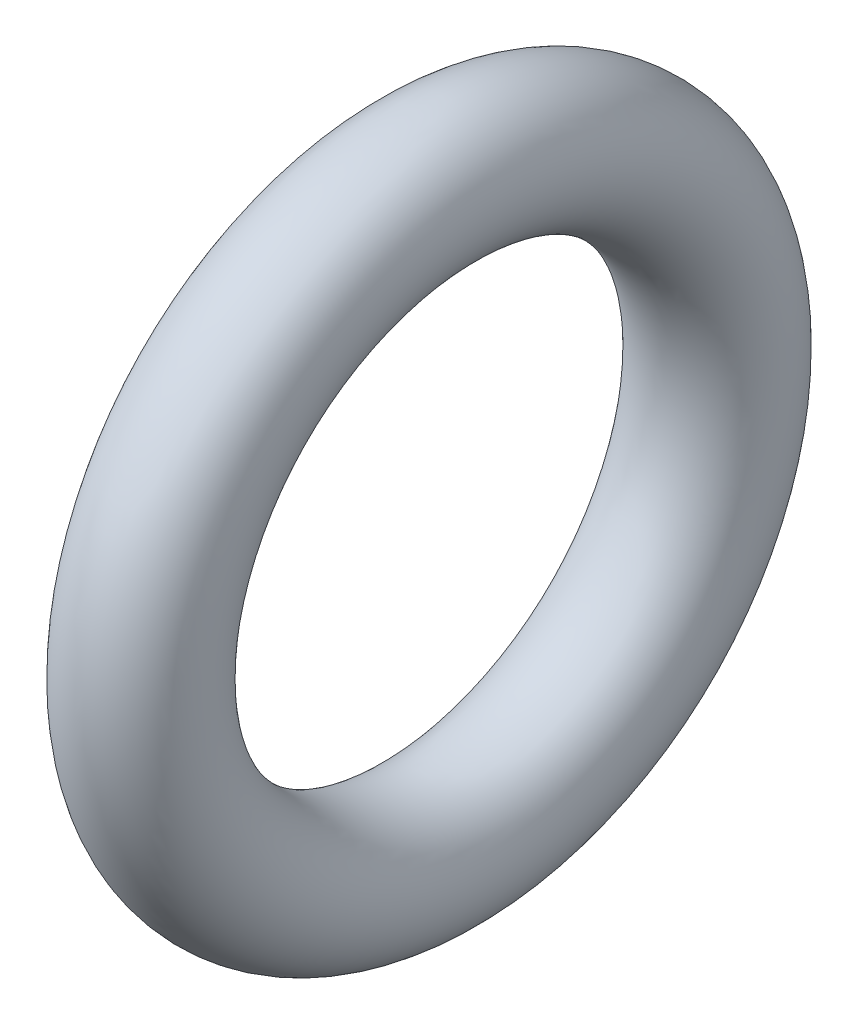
ISO-10303-21;
HEADER;
FILE_DESCRIPTION(('STEP AP214'),'2;1');
FILE_NAME('part.step','',(''),(''),'','','');
FILE_SCHEMA(('AUTOMOTIVE_DESIGN { 1 0 10303 214 1 1 1 1 }'));
ENDSEC;
DATA;
#1=APPLICATION_CONTEXT('core data for automotive mechanical design processes');
#2=APPLICATION_PROTOCOL_DEFINITION('international standard','automotive_design',2000,#1);
#3=PRODUCT_CONTEXT('',#1,'mechanical');
#4=PRODUCT('Part','Part','',(#3));
#5=PRODUCT_RELATED_PRODUCT_CATEGORY('part','',(#4));
#6=PRODUCT_DEFINITION_FORMATION('','',#4);
#7=PRODUCT_DEFINITION_CONTEXT('part definition',#1,'design');
#8=PRODUCT_DEFINITION('design','',#6,#7);
#9=PRODUCT_DEFINITION_SHAPE('','',#8);
#10=(LENGTH_UNIT() NAMED_UNIT(*) SI_UNIT(.MILLI.,.METRE.));
#11=(NAMED_UNIT(*) PLANE_ANGLE_UNIT() SI_UNIT($,.RADIAN.));
#12=(NAMED_UNIT(*) SI_UNIT($,.STERADIAN.) SOLID_ANGLE_UNIT());
#13=UNCERTAINTY_MEASURE_WITH_UNIT(LENGTH_MEASURE(1.E-05),#10,'distance_accuracy_value','');
#14=(GEOMETRIC_REPRESENTATION_CONTEXT(3) GLOBAL_UNCERTAINTY_ASSIGNED_CONTEXT((#13)) GLOBAL_UNIT_ASSIGNED_CONTEXT((#10,
#11,#12)) REPRESENTATION_CONTEXT('',''));
#15=CARTESIAN_POINT('',(0.,0.,0.));
#16=DIRECTION('',(0.,0.,1.));
#17=DIRECTION('',(1.,0.,0.));
#18=AXIS2_PLACEMENT_3D('',#15,#16,#17);
#19=CARTESIAN_POINT('',(3.59561173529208,0.,0.));
#20=DIRECTION('',(-1.,0.,0.));
#21=DIRECTION('',(0.,0.,1.));
#22=AXIS2_PLACEMENT_3D('',#19,#20,#21);
#23=TOROIDAL_SURFACE('',#22,13.4285714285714,3.105);
#24=ADVANCED_FACE('F13',(),#23,.T.);
#25=CLOSED_SHELL('',(#24));
#26=MANIFOLD_SOLID_BREP('B1',#25);
#27=ADVANCED_BREP_SHAPE_REPRESENTATION('',(#18,#26),#14);
#28=SHAPE_DEFINITION_REPRESENTATION(#9,#27);
ENDSEC;
END-ISO-10303-21;
